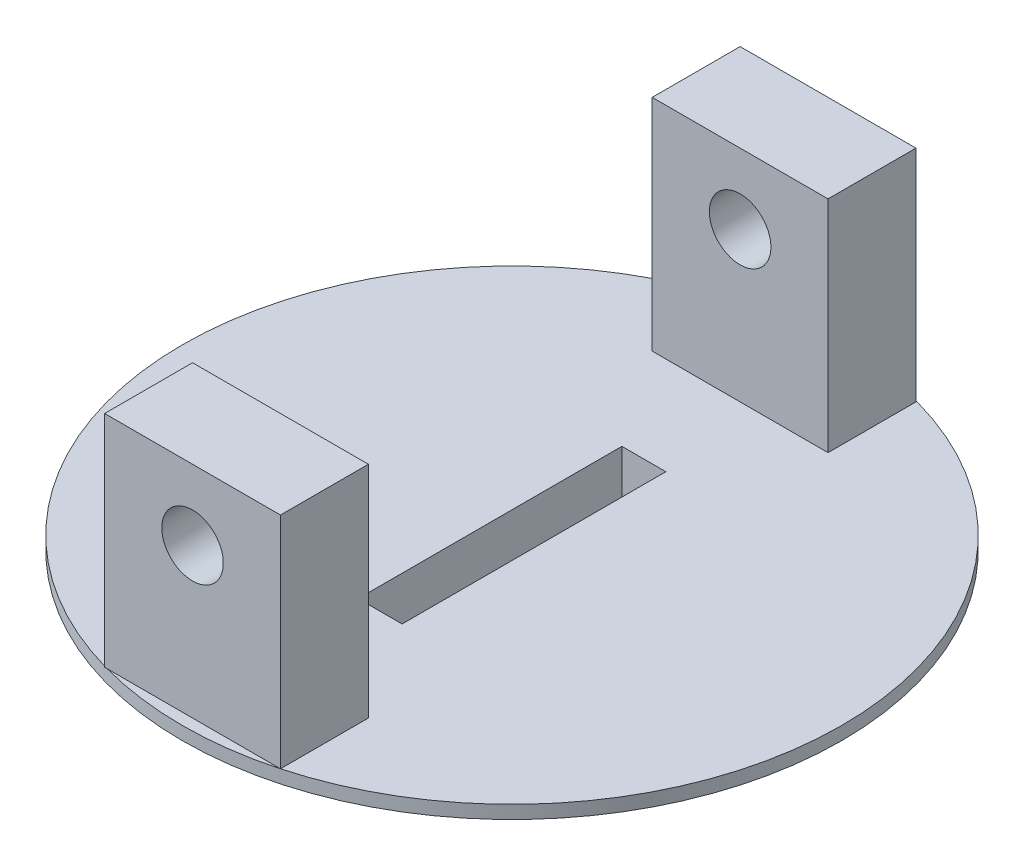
ISO-10303-21;
HEADER;
FILE_DESCRIPTION(('STEP AP214'),'2;1');
FILE_NAME('part.step','',(''),(''),'','','');
FILE_SCHEMA(('AUTOMOTIVE_DESIGN { 1 0 10303 214 1 1 1 1 }'));
ENDSEC;
DATA;
#1=APPLICATION_CONTEXT('core data for automotive mechanical design processes');
#2=APPLICATION_PROTOCOL_DEFINITION('international standard','automotive_design',2000,#1);
#3=PRODUCT_CONTEXT('',#1,'mechanical');
#4=PRODUCT('Part','Part','',(#3));
#5=PRODUCT_RELATED_PRODUCT_CATEGORY('part','',(#4));
#6=PRODUCT_DEFINITION_FORMATION('','',#4);
#7=PRODUCT_DEFINITION_CONTEXT('part definition',#1,'design');
#8=PRODUCT_DEFINITION('design','',#6,#7);
#9=PRODUCT_DEFINITION_SHAPE('','',#8);
#10=(LENGTH_UNIT() NAMED_UNIT(*) SI_UNIT(.MILLI.,.METRE.));
#11=(NAMED_UNIT(*) PLANE_ANGLE_UNIT() SI_UNIT($,.RADIAN.));
#12=(NAMED_UNIT(*) SI_UNIT($,.STERADIAN.) SOLID_ANGLE_UNIT());
#13=UNCERTAINTY_MEASURE_WITH_UNIT(LENGTH_MEASURE(1.E-05),#10,'distance_accuracy_value','');
#14=(GEOMETRIC_REPRESENTATION_CONTEXT(3) GLOBAL_UNCERTAINTY_ASSIGNED_CONTEXT((#13)) GLOBAL_UNIT_ASSIGNED_CONTEXT((#10,
#11,#12)) REPRESENTATION_CONTEXT('',''));
#15=CARTESIAN_POINT('',(0.,0.,0.));
#16=DIRECTION('',(0.,0.,1.));
#17=DIRECTION('',(1.,0.,0.));
#18=AXIS2_PLACEMENT_3D('',#15,#16,#17);
#19=CARTESIAN_POINT('',(9.84810169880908,26.5,36.1837655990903));
#20=DIRECTION('',(-1.,0.,0.));
#21=DIRECTION('',(0.,0.,1.));
#22=AXIS2_PLACEMENT_3D('',#19,#20,#21);
#23=PLANE('',#22);
#24=DIRECTION('',(0.,0.,-1.));
#25=VECTOR('',#24,1.);
#26=CARTESIAN_POINT('',(9.84810169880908,1.5,36.1837655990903));
#27=LINE('',#26,#25);
#28=CARTESIAN_POINT('',(9.84810169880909,1.5,36.1837655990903));
#29=VERTEX_POINT('',#28);
#30=CARTESIAN_POINT('',(9.84810169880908,1.5,26.1837655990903));
#31=VERTEX_POINT('',#30);
#32=EDGE_CURVE('E196',#29,#31,#27,.T.);
#33=ORIENTED_EDGE('',*,*,#32,.T.);
#34=DIRECTION('',(0.,-1.,0.));
#35=VECTOR('',#34,1.);
#36=CARTESIAN_POINT('',(9.84810169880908,1.5,26.1837655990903));
#37=LINE('',#36,#35);
#38=CARTESIAN_POINT('',(9.84810169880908,26.5,26.1837655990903));
#39=VERTEX_POINT('',#38);
#40=EDGE_CURVE('E167',#39,#31,#37,.T.);
#41=ORIENTED_EDGE('',*,*,#40,.F.);
#42=DIRECTION('',(0.,0.,-1.));
#43=VECTOR('',#42,1.);
#44=CARTESIAN_POINT('',(9.84810169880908,26.5,36.1837655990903));
#45=LINE('',#44,#43);
#46=CARTESIAN_POINT('',(9.84810169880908,26.5,36.1837655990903));
#47=VERTEX_POINT('',#46);
#48=EDGE_CURVE('E183',#47,#39,#45,.T.);
#49=ORIENTED_EDGE('',*,*,#48,.F.);
#50=DIRECTION('',(0.,-1.,0.));
#51=VECTOR('',#50,1.);
#52=CARTESIAN_POINT('',(9.84810169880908,26.5,36.1837655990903));
#53=LINE('',#52,#51);
#54=EDGE_CURVE('E195',#47,#29,#53,.T.);
#55=ORIENTED_EDGE('',*,*,#54,.T.);
#56=EDGE_LOOP('',(#33,#41,#49,#55));
#57=FACE_BOUND('',#56,.T.);
#58=ADVANCED_FACE('F34',(#57),#23,.F.);
#59=CARTESIAN_POINT('',(-10.1518983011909,26.5,36.1837655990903));
#60=DIRECTION('',(1.,0.,0.));
#61=DIRECTION('',(0.,0.,-1.));
#62=AXIS2_PLACEMENT_3D('',#59,#60,#61);
#63=PLANE('',#62);
#64=DIRECTION('',(0.,0.,1.));
#65=VECTOR('',#64,1.);
#66=CARTESIAN_POINT('',(-10.1518983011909,26.5,36.1837655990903));
#67=LINE('',#66,#65);
#68=CARTESIAN_POINT('',(-10.1518983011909,26.5,26.1837655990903));
#69=VERTEX_POINT('',#68);
#70=CARTESIAN_POINT('',(-10.1518983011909,26.5,36.1837655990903));
#71=VERTEX_POINT('',#70);
#72=EDGE_CURVE('E189',#69,#71,#67,.T.);
#73=ORIENTED_EDGE('',*,*,#72,.F.);
#74=DIRECTION('',(0.,-1.,0.));
#75=VECTOR('',#74,1.);
#76=CARTESIAN_POINT('',(-10.1518983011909,26.5,26.1837655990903));
#77=LINE('',#76,#75);
#78=CARTESIAN_POINT('',(-10.1518983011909,1.5,26.1837655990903));
#79=VERTEX_POINT('',#78);
#80=EDGE_CURVE('E179',#69,#79,#77,.T.);
#81=ORIENTED_EDGE('',*,*,#80,.T.);
#82=DIRECTION('',(0.,0.,1.));
#83=VECTOR('',#82,1.);
#84=CARTESIAN_POINT('',(-10.1518983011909,1.5,36.1837655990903));
#85=LINE('',#84,#83);
#86=CARTESIAN_POINT('',(-10.1518983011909,1.5,36.0997085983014));
#87=VERTEX_POINT('',#86);
#88=EDGE_CURVE('E207',#79,#87,#85,.T.);
#89=ORIENTED_EDGE('',*,*,#88,.T.);
#90=CARTESIAN_POINT('',(-10.1518983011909,1.5,36.1837655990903));
#91=VERTEX_POINT('',#90);
#92=EDGE_CURVE('E202',#87,#91,#85,.T.);
#93=ORIENTED_EDGE('',*,*,#92,.T.);
#94=DIRECTION('',(0.,-1.,0.));
#95=VECTOR('',#94,1.);
#96=CARTESIAN_POINT('',(-10.1518983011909,26.5,36.1837655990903));
#97=LINE('',#96,#95);
#98=EDGE_CURVE('E213',#71,#91,#97,.T.);
#99=ORIENTED_EDGE('',*,*,#98,.F.);
#100=EDGE_LOOP('',(#73,#81,#89,#93,#99));
#101=FACE_BOUND('',#100,.T.);
#102=ADVANCED_FACE('F264',(#101),#63,.F.);
#103=CARTESIAN_POINT('',(0.,26.5,0.));
#104=DIRECTION('',(0.,1.,0.));
#105=DIRECTION('',(0.,0.,1.));
#106=AXIS2_PLACEMENT_3D('',#103,#104,#105);
#107=PLANE('',#106);
#108=DIRECTION('',(1.,0.,0.));
#109=VECTOR('',#108,1.);
#110=CARTESIAN_POINT('',(0.,26.5,26.1837655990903));
#111=LINE('',#110,#109);
#112=EDGE_CURVE('E237',#69,#39,#111,.T.);
#113=ORIENTED_EDGE('',*,*,#112,.F.);
#114=ORIENTED_EDGE('',*,*,#72,.T.);
#115=DIRECTION('',(1.,0.,0.));
#116=VECTOR('',#115,1.);
#117=CARTESIAN_POINT('',(9.84810169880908,26.5,36.1837655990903));
#118=LINE('',#117,#116);
#119=EDGE_CURVE('E193',#71,#47,#118,.T.);
#120=ORIENTED_EDGE('',*,*,#119,.T.);
#121=ORIENTED_EDGE('',*,*,#48,.T.);
#122=EDGE_LOOP('',(#113,#114,#120,#121));
#123=FACE_BOUND('',#122,.T.);
#124=ADVANCED_FACE('F271',(#123),#107,.T.);
#125=CARTESIAN_POINT('',(0.,1.5,0.));
#126=DIRECTION('',(0.,1.,0.));
#127=DIRECTION('',(0.,0.,1.));
#128=AXIS2_PLACEMENT_3D('',#125,#126,#127);
#129=PLANE('',#128);
#130=DIRECTION('',(1.,0.,0.));
#131=VECTOR('',#130,1.);
#132=CARTESIAN_POINT('',(9.84810169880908,1.5,36.1837655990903));
#133=LINE('',#132,#131);
#134=CARTESIAN_POINT('',(-9.84810169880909,1.5,36.1837655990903));
#135=VERTEX_POINT('',#134);
#136=EDGE_CURVE('E210',#135,#29,#133,.T.);
#137=ORIENTED_EDGE('',*,*,#136,.F.);
#138=CARTESIAN_POINT('',(0.,1.5,0.));
#139=DIRECTION('',(0.,1.,0.));
#140=DIRECTION('',(0.,0.,1.));
#141=AXIS2_PLACEMENT_3D('',#138,#139,#140);
#142=CIRCLE('',#141,37.5);
#143=EDGE_CURVE('E229',#135,#29,#142,.T.);
#144=ORIENTED_EDGE('',*,*,#143,.T.);
#145=EDGE_LOOP('',(#137,#144));
#146=FACE_BOUND('',#145,.T.);
#147=ADVANCED_FACE('F320',(#146),#129,.T.);
#148=CARTESIAN_POINT('',(0.,1.5,0.));
#149=DIRECTION('',(0.,-1.,0.));
#150=DIRECTION('',(0.,0.,-1.));
#151=AXIS2_PLACEMENT_3D('',#148,#149,#150);
#152=CYLINDRICAL_SURFACE('',#151,37.5);
#153=CARTESIAN_POINT('',(-10.1518983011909,1.5,-36.0997085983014));
#154=VERTEX_POINT('',#153);
#155=EDGE_CURVE('E226',#29,#154,#142,.T.);
#156=ORIENTED_EDGE('',*,*,#155,.F.);
#157=ORIENTED_EDGE('',*,*,#143,.F.);
#158=EDGE_CURVE('E316',#87,#135,#142,.T.);
#159=ORIENTED_EDGE('',*,*,#158,.F.);
#160=EDGE_CURVE('E228',#154,#87,#142,.T.);
#161=ORIENTED_EDGE('',*,*,#160,.F.);
#162=EDGE_LOOP('',(#156,#157,#159,#161));
#163=FACE_BOUND('',#162,.T.);
#164=CARTESIAN_POINT('',(0.,0.,0.));
#165=DIRECTION('',(0.,1.,0.));
#166=DIRECTION('',(0.,0.,1.));
#167=AXIS2_PLACEMENT_3D('',#164,#165,#166);
#168=CIRCLE('',#167,37.5);
#169=CARTESIAN_POINT('',(0.,0.,37.5));
#170=VERTEX_POINT('',#169);
#171=EDGE_CURVE('E230',#170,#170,#168,.T.);
#172=ORIENTED_EDGE('',*,*,#171,.T.);
#173=EDGE_LOOP('',(#172));
#174=FACE_BOUND('',#173,.T.);
#175=ADVANCED_FACE('F36',(#163,#174),#152,.T.);
#176=DIRECTION('',(0.,0.,-1.));
#177=VECTOR('',#176,1.);
#178=CARTESIAN_POINT('',(2.5,1.5,-15.));
#179=LINE('',#178,#177);
#180=CARTESIAN_POINT('',(2.5,1.5,15.));
#181=VERTEX_POINT('',#180);
#182=CARTESIAN_POINT('',(2.5,1.5,-15.));
#183=VERTEX_POINT('',#182);
#184=EDGE_CURVE('E49',#181,#183,#179,.T.);
#185=ORIENTED_EDGE('',*,*,#184,.F.);
#186=DIRECTION('',(1.,0.,0.));
#187=VECTOR('',#186,1.);
#188=CARTESIAN_POINT('',(2.5,1.5,15.));
#189=LINE('',#188,#187);
#190=CARTESIAN_POINT('',(-2.5,1.5,15.));
#191=VERTEX_POINT('',#190);
#192=EDGE_CURVE('E148',#191,#181,#189,.T.);
#193=ORIENTED_EDGE('',*,*,#192,.F.);
#194=DIRECTION('',(0.,0.,1.));
#195=VECTOR('',#194,1.);
#196=CARTESIAN_POINT('',(-2.5,1.5,-15.));
#197=LINE('',#196,#195);
#198=CARTESIAN_POINT('',(-2.5,1.5,-15.));
#199=VERTEX_POINT('',#198);
#200=EDGE_CURVE('E132',#199,#191,#197,.T.);
#201=ORIENTED_EDGE('',*,*,#200,.F.);
#202=DIRECTION('',(-1.,0.,0.));
#203=VECTOR('',#202,1.);
#204=CARTESIAN_POINT('',(2.5,1.5,-15.));
#205=LINE('',#204,#203);
#206=EDGE_CURVE('E141',#183,#199,#205,.T.);
#207=ORIENTED_EDGE('',*,*,#206,.F.);
#208=EDGE_LOOP('',(#185,#193,#201,#207));
#209=FACE_BOUND('',#208,.T.);
#210=ORIENTED_EDGE('',*,*,#88,.F.);
#211=DIRECTION('',(1.,0.,0.));
#212=VECTOR('',#211,1.);
#213=CARTESIAN_POINT('',(-15.1518983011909,1.5,26.1837655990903));
#214=LINE('',#213,#212);
#215=EDGE_CURVE('E172',#79,#31,#214,.T.);
#216=ORIENTED_EDGE('',*,*,#215,.T.);
#217=ORIENTED_EDGE('',*,*,#32,.F.);
#218=ORIENTED_EDGE('',*,*,#155,.T.);
#219=DIRECTION('',(-1.,0.,0.));
#220=VECTOR('',#219,1.);
#221=CARTESIAN_POINT('',(9.84810169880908,1.5,-36.0997085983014));
#222=LINE('',#221,#220);
#223=CARTESIAN_POINT('',(9.84810169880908,1.5,-36.0997085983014));
#224=VERTEX_POINT('',#223);
#225=EDGE_CURVE('E199',#224,#154,#222,.T.);
#226=ORIENTED_EDGE('',*,*,#225,.F.);
#227=CARTESIAN_POINT('',(9.84810169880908,1.5,-26.0997085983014));
#228=VERTEX_POINT('',#227);
#229=EDGE_CURVE('E182',#228,#224,#27,.T.);
#230=ORIENTED_EDGE('',*,*,#229,.F.);
#231=DIRECTION('',(1.,0.,0.));
#232=VECTOR('',#231,1.);
#233=CARTESIAN_POINT('',(-15.1518983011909,1.5,-26.0997085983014));
#234=LINE('',#233,#232);
#235=CARTESIAN_POINT('',(-10.1518983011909,1.5,-26.0997085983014));
#236=VERTEX_POINT('',#235);
#237=EDGE_CURVE('E173',#236,#228,#234,.T.);
#238=ORIENTED_EDGE('',*,*,#237,.F.);
#239=EDGE_CURVE('E203',#154,#236,#85,.T.);
#240=ORIENTED_EDGE('',*,*,#239,.F.);
#241=ORIENTED_EDGE('',*,*,#160,.T.);
#242=EDGE_LOOP('',(#210,#216,#217,#218,#226,#230,#238,#240,#241));
#243=FACE_BOUND('',#242,.T.);
#244=ADVANCED_FACE('F145',(#209,#243),#129,.T.);
#245=CARTESIAN_POINT('',(0.,0.,0.));
#246=DIRECTION('',(0.,1.,0.));
#247=DIRECTION('',(0.,0.,1.));
#248=AXIS2_PLACEMENT_3D('',#245,#246,#247);
#249=PLANE('',#248);
#250=CARTESIAN_POINT('',(0.,0.,0.));
#251=DIRECTION('',(0.,1.,0.));
#252=DIRECTION('',(0.,0.,1.));
#253=AXIS2_PLACEMENT_3D('',#250,#251,#252);
#254=CIRCLE('',#253,17.5);
#255=CARTESIAN_POINT('',(0.,0.,17.5));
#256=VERTEX_POINT('',#255);
#257=EDGE_CURVE('E225',#256,#256,#254,.T.);
#258=ORIENTED_EDGE('',*,*,#257,.T.);
#259=EDGE_LOOP('',(#258));
#260=FACE_BOUND('',#259,.T.);
#261=ORIENTED_EDGE('',*,*,#171,.F.);
#262=EDGE_LOOP('',(#261));
#263=FACE_BOUND('',#262,.T.);
#264=ADVANCED_FACE('F404',(#260,#263),#249,.F.);
#265=CARTESIAN_POINT('',(0.,-6.5,0.));
#266=DIRECTION('',(0.,1.,0.));
#267=DIRECTION('',(0.,0.,1.));
#268=AXIS2_PLACEMENT_3D('',#265,#266,#267);
#269=CYLINDRICAL_SURFACE('',#268,17.5);
#270=CARTESIAN_POINT('',(0.,-6.5,0.));
#271=DIRECTION('',(0.,1.,0.));
#272=DIRECTION('',(0.,0.,1.));
#273=AXIS2_PLACEMENT_3D('',#270,#271,#272);
#274=CIRCLE('',#273,17.5);
#275=CARTESIAN_POINT('',(0.,-6.5,17.5));
#276=VERTEX_POINT('',#275);
#277=EDGE_CURVE('E222',#276,#276,#274,.T.);
#278=ORIENTED_EDGE('',*,*,#277,.T.);
#279=EDGE_LOOP('',(#278));
#280=FACE_BOUND('',#279,.T.);
#281=ORIENTED_EDGE('',*,*,#257,.F.);
#282=EDGE_LOOP('',(#281));
#283=FACE_BOUND('',#282,.T.);
#284=ADVANCED_FACE('F397',(#280,#283),#269,.T.);
#285=CARTESIAN_POINT('',(0.,-6.5,0.));
#286=DIRECTION('',(0.,1.,0.));
#287=DIRECTION('',(0.,0.,1.));
#288=AXIS2_PLACEMENT_3D('',#285,#286,#287);
#289=PLANE('',#288);
#290=DIRECTION('',(1.,0.,0.));
#291=VECTOR('',#290,1.);
#292=CARTESIAN_POINT('',(0.,-6.5,15.));
#293=LINE('',#292,#291);
#294=CARTESIAN_POINT('',(-2.5,-6.5,15.));
#295=VERTEX_POINT('',#294);
#296=CARTESIAN_POINT('',(2.5,-6.5,15.));
#297=VERTEX_POINT('',#296);
#298=EDGE_CURVE('E42',#295,#297,#293,.T.);
#299=ORIENTED_EDGE('',*,*,#298,.T.);
#300=DIRECTION('',(0.,0.,-1.));
#301=VECTOR('',#300,1.);
#302=CARTESIAN_POINT('',(2.5,-6.5,0.));
#303=LINE('',#302,#301);
#304=CARTESIAN_POINT('',(2.5,-6.5,-15.));
#305=VERTEX_POINT('',#304);
#306=EDGE_CURVE('E11',#297,#305,#303,.T.);
#307=ORIENTED_EDGE('',*,*,#306,.T.);
#308=DIRECTION('',(-1.,0.,0.));
#309=VECTOR('',#308,1.);
#310=CARTESIAN_POINT('',(0.,-6.5,-15.));
#311=LINE('',#310,#309);
#312=CARTESIAN_POINT('',(-2.5,-6.5,-15.));
#313=VERTEX_POINT('',#312);
#314=EDGE_CURVE('E239',#305,#313,#311,.T.);
#315=ORIENTED_EDGE('',*,*,#314,.T.);
#316=DIRECTION('',(0.,0.,1.));
#317=VECTOR('',#316,1.);
#318=CARTESIAN_POINT('',(-2.5,-6.5,0.));
#319=LINE('',#318,#317);
#320=EDGE_CURVE('E135',#313,#295,#319,.T.);
#321=ORIENTED_EDGE('',*,*,#320,.T.);
#322=EDGE_LOOP('',(#299,#307,#315,#321));
#323=FACE_BOUND('',#322,.T.);
#324=ORIENTED_EDGE('',*,*,#277,.F.);
#325=EDGE_LOOP('',(#324));
#326=FACE_BOUND('',#325,.T.);
#327=ADVANCED_FACE('F245',(#323,#326),#289,.F.);
#328=CARTESIAN_POINT('',(0.,1.5,0.));
#329=DIRECTION('',(0.,1.,0.));
#330=DIRECTION('',(0.,0.,1.));
#331=AXIS2_PLACEMENT_3D('',#328,#329,#330);
#332=PLANE('',#331);
#333=ORIENTED_EDGE('',*,*,#92,.F.);
#334=ORIENTED_EDGE('',*,*,#158,.T.);
#335=EDGE_CURVE('E206',#91,#135,#133,.T.);
#336=ORIENTED_EDGE('',*,*,#335,.F.);
#337=EDGE_LOOP('',(#333,#334,#336));
#338=FACE_BOUND('',#337,.T.);
#339=ADVANCED_FACE('F279',(#338),#332,.F.);
#340=CARTESIAN_POINT('',(9.84810169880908,26.5,-26.0997085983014));
#341=VERTEX_POINT('',#340);
#342=CARTESIAN_POINT('',(9.84810169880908,26.5,-36.0997085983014));
#343=VERTEX_POINT('',#342);
#344=EDGE_CURVE('E187',#341,#343,#45,.T.);
#345=ORIENTED_EDGE('',*,*,#344,.F.);
#346=DIRECTION('',(0.,1.,0.));
#347=VECTOR('',#346,1.);
#348=CARTESIAN_POINT('',(9.84810169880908,1.5,-26.0997085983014));
#349=LINE('',#348,#347);
#350=EDGE_CURVE('E170',#228,#341,#349,.T.);
#351=ORIENTED_EDGE('',*,*,#350,.F.);
#352=ORIENTED_EDGE('',*,*,#229,.T.);
#353=DIRECTION('',(0.,-1.,0.));
#354=VECTOR('',#353,1.);
#355=CARTESIAN_POINT('',(9.84810169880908,26.5,-36.0997085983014));
#356=LINE('',#355,#354);
#357=EDGE_CURVE('E219',#343,#224,#356,.T.);
#358=ORIENTED_EDGE('',*,*,#357,.F.);
#359=EDGE_LOOP('',(#345,#351,#352,#358));
#360=FACE_BOUND('',#359,.T.);
#361=ADVANCED_FACE('F267',(#360),#23,.F.);
#362=CARTESIAN_POINT('',(9.84810169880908,26.5,-36.0997085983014));
#363=DIRECTION('',(0.,0.,1.));
#364=DIRECTION('',(1.,0.,0.));
#365=AXIS2_PLACEMENT_3D('',#362,#363,#364);
#366=PLANE('',#365);
#367=CARTESIAN_POINT('',(-0.151898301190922,18.5,-36.0997085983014));
#368=DIRECTION('',(0.,0.,-1.));
#369=DIRECTION('',(-1.,0.,0.));
#370=AXIS2_PLACEMENT_3D('',#367,#368,#369);
#371=CIRCLE('',#370,3.5);
#372=CARTESIAN_POINT('',(-3.65189830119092,18.5,-36.0997085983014));
#373=VERTEX_POINT('',#372);
#374=EDGE_CURVE('E155',#373,#373,#371,.T.);
#375=ORIENTED_EDGE('',*,*,#374,.F.);
#376=EDGE_LOOP('',(#375));
#377=FACE_BOUND('',#376,.T.);
#378=ORIENTED_EDGE('',*,*,#225,.T.);
#379=DIRECTION('',(0.,-1.,0.));
#380=VECTOR('',#379,1.);
#381=CARTESIAN_POINT('',(-10.1518983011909,26.5,-36.0997085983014));
#382=LINE('',#381,#380);
#383=CARTESIAN_POINT('',(-10.1518983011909,26.5,-36.0997085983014));
#384=VERTEX_POINT('',#383);
#385=EDGE_CURVE('E216',#384,#154,#382,.T.);
#386=ORIENTED_EDGE('',*,*,#385,.F.);
#387=DIRECTION('',(-1.,0.,0.));
#388=VECTOR('',#387,1.);
#389=CARTESIAN_POINT('',(9.84810169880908,26.5,-36.0997085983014));
#390=LINE('',#389,#388);
#391=EDGE_CURVE('E186',#343,#384,#390,.T.);
#392=ORIENTED_EDGE('',*,*,#391,.F.);
#393=ORIENTED_EDGE('',*,*,#357,.T.);
#394=EDGE_LOOP('',(#378,#386,#392,#393));
#395=FACE_BOUND('',#394,.T.);
#396=ADVANCED_FACE('F278',(#377,#395),#366,.F.);
#397=ORIENTED_EDGE('',*,*,#239,.T.);
#398=DIRECTION('',(0.,1.,0.));
#399=VECTOR('',#398,1.);
#400=CARTESIAN_POINT('',(-10.1518983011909,26.5,-26.0997085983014));
#401=LINE('',#400,#399);
#402=CARTESIAN_POINT('',(-10.1518983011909,26.5,-26.0997085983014));
#403=VERTEX_POINT('',#402);
#404=EDGE_CURVE('E175',#236,#403,#401,.T.);
#405=ORIENTED_EDGE('',*,*,#404,.T.);
#406=EDGE_CURVE('E190',#384,#403,#67,.T.);
#407=ORIENTED_EDGE('',*,*,#406,.F.);
#408=ORIENTED_EDGE('',*,*,#385,.T.);
#409=EDGE_LOOP('',(#397,#405,#407,#408));
#410=FACE_BOUND('',#409,.T.);
#411=ADVANCED_FACE('F274',(#410),#63,.F.);
#412=CARTESIAN_POINT('',(9.84810169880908,26.5,36.1837655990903));
#413=DIRECTION('',(0.,0.,-1.));
#414=DIRECTION('',(-1.,0.,0.));
#415=AXIS2_PLACEMENT_3D('',#412,#413,#414);
#416=PLANE('',#415);
#417=CARTESIAN_POINT('',(-0.151898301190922,18.5,36.1837655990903));
#418=DIRECTION('',(0.,0.,-1.));
#419=DIRECTION('',(-1.,0.,0.));
#420=AXIS2_PLACEMENT_3D('',#417,#418,#419);
#421=CIRCLE('',#420,3.5);
#422=CARTESIAN_POINT('',(-3.65189830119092,18.5,36.1837655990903));
#423=VERTEX_POINT('',#422);
#424=EDGE_CURVE('E164',#423,#423,#421,.T.);
#425=ORIENTED_EDGE('',*,*,#424,.T.);
#426=EDGE_LOOP('',(#425));
#427=FACE_BOUND('',#426,.T.);
#428=ORIENTED_EDGE('',*,*,#335,.T.);
#429=ORIENTED_EDGE('',*,*,#136,.T.);
#430=ORIENTED_EDGE('',*,*,#54,.F.);
#431=ORIENTED_EDGE('',*,*,#119,.F.);
#432=ORIENTED_EDGE('',*,*,#98,.T.);
#433=EDGE_LOOP('',(#428,#429,#430,#431,#432));
#434=FACE_BOUND('',#433,.T.);
#435=ADVANCED_FACE('F323',(#427,#434),#416,.F.);
#436=DIRECTION('',(-1.,0.,0.));
#437=VECTOR('',#436,1.);
#438=CARTESIAN_POINT('',(0.,26.5,-26.0997085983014));
#439=LINE('',#438,#437);
#440=EDGE_CURVE('E235',#341,#403,#439,.T.);
#441=ORIENTED_EDGE('',*,*,#440,.F.);
#442=ORIENTED_EDGE('',*,*,#344,.T.);
#443=ORIENTED_EDGE('',*,*,#391,.T.);
#444=ORIENTED_EDGE('',*,*,#406,.T.);
#445=EDGE_LOOP('',(#441,#442,#443,#444));
#446=FACE_BOUND('',#445,.T.);
#447=ADVANCED_FACE('F295',(#446),#107,.T.);
#448=CARTESIAN_POINT('',(-15.1518983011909,1.5,26.1837655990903));
#449=DIRECTION('',(0.,0.,1.));
#450=DIRECTION('',(1.,0.,0.));
#451=AXIS2_PLACEMENT_3D('',#448,#449,#450);
#452=PLANE('',#451);
#453=CARTESIAN_POINT('',(-0.151898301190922,18.5,26.1837655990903));
#454=DIRECTION('',(0.,0.,1.));
#455=DIRECTION('',(1.,0.,0.));
#456=AXIS2_PLACEMENT_3D('',#453,#454,#455);
#457=CIRCLE('',#456,3.5);
#458=CARTESIAN_POINT('',(3.34810169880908,18.5,26.1837655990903));
#459=VERTEX_POINT('',#458);
#460=EDGE_CURVE('E161',#459,#459,#457,.T.);
#461=ORIENTED_EDGE('',*,*,#460,.T.);
#462=EDGE_LOOP('',(#461));
#463=FACE_BOUND('',#462,.T.);
#464=ORIENTED_EDGE('',*,*,#112,.T.);
#465=ORIENTED_EDGE('',*,*,#40,.T.);
#466=ORIENTED_EDGE('',*,*,#215,.F.);
#467=ORIENTED_EDGE('',*,*,#80,.F.);
#468=EDGE_LOOP('',(#464,#465,#466,#467));
#469=FACE_BOUND('',#468,.T.);
#470=ADVANCED_FACE('F332',(#463,#469),#452,.F.);
#471=CARTESIAN_POINT('',(-15.1518983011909,1.5,-26.0997085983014));
#472=DIRECTION('',(0.,0.,-1.));
#473=DIRECTION('',(-1.,0.,0.));
#474=AXIS2_PLACEMENT_3D('',#471,#472,#473);
#475=PLANE('',#474);
#476=CARTESIAN_POINT('',(-0.151898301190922,18.5,-26.0997085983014));
#477=DIRECTION('',(0.,0.,-1.));
#478=DIRECTION('',(-1.,0.,0.));
#479=AXIS2_PLACEMENT_3D('',#476,#477,#478);
#480=CIRCLE('',#479,3.5);
#481=CARTESIAN_POINT('',(-3.65189830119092,18.5,-26.0997085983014));
#482=VERTEX_POINT('',#481);
#483=EDGE_CURVE('E160',#482,#482,#480,.T.);
#484=ORIENTED_EDGE('',*,*,#483,.T.);
#485=EDGE_LOOP('',(#484));
#486=FACE_BOUND('',#485,.T.);
#487=ORIENTED_EDGE('',*,*,#237,.T.);
#488=ORIENTED_EDGE('',*,*,#350,.T.);
#489=ORIENTED_EDGE('',*,*,#440,.T.);
#490=ORIENTED_EDGE('',*,*,#404,.F.);
#491=EDGE_LOOP('',(#487,#488,#489,#490));
#492=FACE_BOUND('',#491,.T.);
#493=ADVANCED_FACE('F304',(#486,#492),#475,.F.);
#494=CARTESIAN_POINT('',(-0.151898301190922,18.5,37.5));
#495=DIRECTION('',(0.,0.,-1.));
#496=DIRECTION('',(-1.,0.,0.));
#497=AXIS2_PLACEMENT_3D('',#494,#495,#496);
#498=CYLINDRICAL_SURFACE('',#497,3.5);
#499=ORIENTED_EDGE('',*,*,#374,.T.);
#500=EDGE_LOOP('',(#499));
#501=FACE_BOUND('',#500,.T.);
#502=ORIENTED_EDGE('',*,*,#483,.F.);
#503=EDGE_LOOP('',(#502));
#504=FACE_BOUND('',#503,.T.);
#505=ADVANCED_FACE('F259',(#501,#504),#498,.F.);
#506=ORIENTED_EDGE('',*,*,#460,.F.);
#507=EDGE_LOOP('',(#506));
#508=FACE_BOUND('',#507,.T.);
#509=ORIENTED_EDGE('',*,*,#424,.F.);
#510=EDGE_LOOP('',(#509));
#511=FACE_BOUND('',#510,.T.);
#512=ADVANCED_FACE('F252',(#508,#511),#498,.F.);
#513=CARTESIAN_POINT('',(2.5,-10.5,-15.));
#514=DIRECTION('',(1.,0.,0.));
#515=DIRECTION('',(0.,0.,-1.));
#516=AXIS2_PLACEMENT_3D('',#513,#514,#515);
#517=PLANE('',#516);
#518=DIRECTION('',(0.,1.,0.));
#519=VECTOR('',#518,1.);
#520=CARTESIAN_POINT('',(2.5,-10.5,15.));
#521=LINE('',#520,#519);
#522=EDGE_CURVE('E153',#297,#181,#521,.T.);
#523=ORIENTED_EDGE('',*,*,#522,.T.);
#524=ORIENTED_EDGE('',*,*,#184,.T.);
#525=DIRECTION('',(0.,1.,0.));
#526=VECTOR('',#525,1.);
#527=CARTESIAN_POINT('',(2.5,-10.5,-15.));
#528=LINE('',#527,#526);
#529=EDGE_CURVE('E138',#305,#183,#528,.T.);
#530=ORIENTED_EDGE('',*,*,#529,.F.);
#531=ORIENTED_EDGE('',*,*,#306,.F.);
#532=EDGE_LOOP('',(#523,#524,#530,#531));
#533=FACE_BOUND('',#532,.T.);
#534=ADVANCED_FACE('F250',(#533),#517,.F.);
#535=CARTESIAN_POINT('',(2.5,-10.5,15.));
#536=DIRECTION('',(0.,0.,1.));
#537=DIRECTION('',(1.,0.,0.));
#538=AXIS2_PLACEMENT_3D('',#535,#536,#537);
#539=PLANE('',#538);
#540=DIRECTION('',(0.,1.,0.));
#541=VECTOR('',#540,1.);
#542=CARTESIAN_POINT('',(-2.5,-10.5,15.));
#543=LINE('',#542,#541);
#544=EDGE_CURVE('E137',#295,#191,#543,.T.);
#545=ORIENTED_EDGE('',*,*,#544,.T.);
#546=ORIENTED_EDGE('',*,*,#192,.T.);
#547=ORIENTED_EDGE('',*,*,#522,.F.);
#548=ORIENTED_EDGE('',*,*,#298,.F.);
#549=EDGE_LOOP('',(#545,#546,#547,#548));
#550=FACE_BOUND('',#549,.T.);
#551=ADVANCED_FACE('F249',(#550),#539,.F.);
#552=CARTESIAN_POINT('',(-2.5,-10.5,-15.));
#553=DIRECTION('',(-1.,0.,0.));
#554=DIRECTION('',(0.,0.,1.));
#555=AXIS2_PLACEMENT_3D('',#552,#553,#554);
#556=PLANE('',#555);
#557=DIRECTION('',(0.,1.,0.));
#558=VECTOR('',#557,1.);
#559=CARTESIAN_POINT('',(-2.5,-10.5,-15.));
#560=LINE('',#559,#558);
#561=EDGE_CURVE('E57',#313,#199,#560,.T.);
#562=ORIENTED_EDGE('',*,*,#561,.T.);
#563=ORIENTED_EDGE('',*,*,#200,.T.);
#564=ORIENTED_EDGE('',*,*,#544,.F.);
#565=ORIENTED_EDGE('',*,*,#320,.F.);
#566=EDGE_LOOP('',(#562,#563,#564,#565));
#567=FACE_BOUND('',#566,.T.);
#568=ADVANCED_FACE('F129',(#567),#556,.F.);
#569=CARTESIAN_POINT('',(2.5,-10.5,-15.));
#570=DIRECTION('',(0.,0.,-1.));
#571=DIRECTION('',(-1.,0.,0.));
#572=AXIS2_PLACEMENT_3D('',#569,#570,#571);
#573=PLANE('',#572);
#574=ORIENTED_EDGE('',*,*,#529,.T.);
#575=ORIENTED_EDGE('',*,*,#206,.T.);
#576=ORIENTED_EDGE('',*,*,#561,.F.);
#577=ORIENTED_EDGE('',*,*,#314,.F.);
#578=EDGE_LOOP('',(#574,#575,#576,#577));
#579=FACE_BOUND('',#578,.T.);
#580=ADVANCED_FACE('F142',(#579),#573,.F.);
#581=CLOSED_SHELL('',(#58,#102,#124,#147,#175,#244,#264,#284,#327,#339,#361,#396,#411,#435,#447,
#470,#493,#505,#512,#534,#551,#568,#580));
#582=MANIFOLD_SOLID_BREP('B2',#581);
#583=ADVANCED_BREP_SHAPE_REPRESENTATION('',(#18,#582),#14);
#584=SHAPE_DEFINITION_REPRESENTATION(#9,#583);
ENDSEC;
END-ISO-10303-21;
